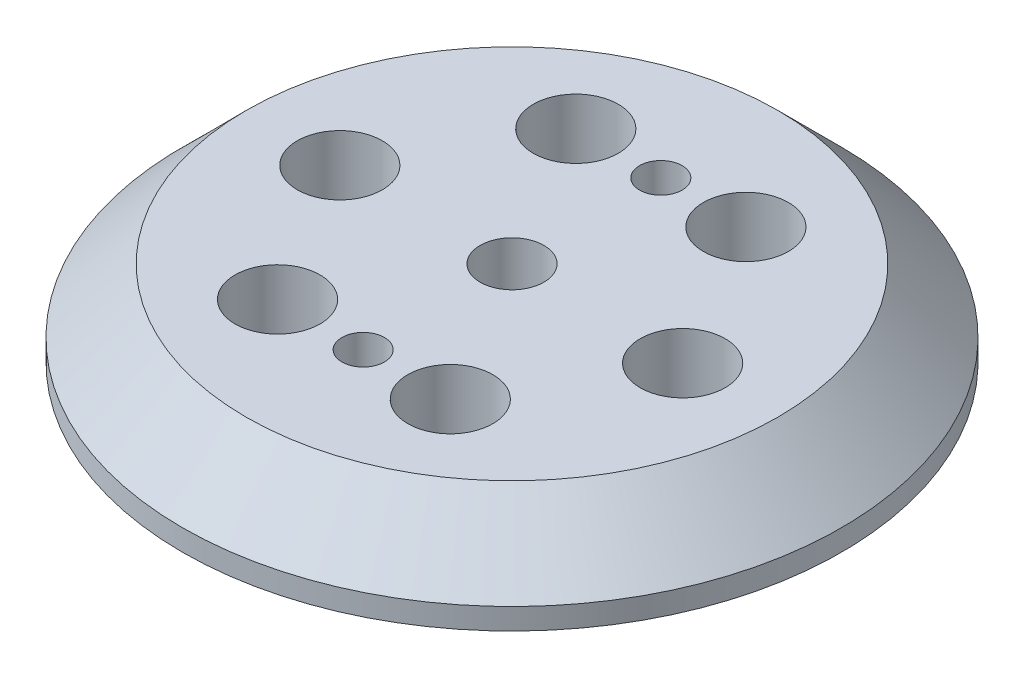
ISO-10303-21;
HEADER;
FILE_DESCRIPTION(('STEP AP214'),'2;1');
FILE_NAME('part.step','',(''),(''),'','','');
FILE_SCHEMA(('AUTOMOTIVE_DESIGN { 1 0 10303 214 1 1 1 1 }'));
ENDSEC;
DATA;
#1=APPLICATION_CONTEXT('core data for automotive mechanical design processes');
#2=APPLICATION_PROTOCOL_DEFINITION('international standard','automotive_design',2000,#1);
#3=PRODUCT_CONTEXT('',#1,'mechanical');
#4=PRODUCT('Part','Part','',(#3));
#5=PRODUCT_RELATED_PRODUCT_CATEGORY('part','',(#4));
#6=PRODUCT_DEFINITION_FORMATION('','',#4);
#7=PRODUCT_DEFINITION_CONTEXT('part definition',#1,'design');
#8=PRODUCT_DEFINITION('design','',#6,#7);
#9=PRODUCT_DEFINITION_SHAPE('','',#8);
#10=(LENGTH_UNIT() NAMED_UNIT(*) SI_UNIT(.MILLI.,.METRE.));
#11=(NAMED_UNIT(*) PLANE_ANGLE_UNIT() SI_UNIT($,.RADIAN.));
#12=(NAMED_UNIT(*) SI_UNIT($,.STERADIAN.) SOLID_ANGLE_UNIT());
#13=UNCERTAINTY_MEASURE_WITH_UNIT(LENGTH_MEASURE(1.E-05),#10,'distance_accuracy_value','');
#14=(GEOMETRIC_REPRESENTATION_CONTEXT(3) GLOBAL_UNCERTAINTY_ASSIGNED_CONTEXT((#13)) GLOBAL_UNIT_ASSIGNED_CONTEXT((#10,
#11,#12)) REPRESENTATION_CONTEXT('',''));
#15=CARTESIAN_POINT('',(0.,0.,0.));
#16=DIRECTION('',(0.,0.,1.));
#17=DIRECTION('',(1.,0.,0.));
#18=AXIS2_PLACEMENT_3D('',#15,#16,#17);
#19=CARTESIAN_POINT('',(0.,4.,0.));
#20=DIRECTION('',(0.,-1.,0.));
#21=DIRECTION('',(0.,0.,-1.));
#22=AXIS2_PLACEMENT_3D('',#19,#20,#21);
#23=CYLINDRICAL_SURFACE('',#22,15.5);
#24=CARTESIAN_POINT('',(0.,0.999999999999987,0.));
#25=DIRECTION('',(0.,1.,0.));
#26=DIRECTION('',(0.,0.,1.));
#27=AXIS2_PLACEMENT_3D('',#24,#25,#26);
#28=CIRCLE('',#27,15.5);
#29=CARTESIAN_POINT('',(0.,0.999999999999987,15.5));
#30=VERTEX_POINT('',#29);
#31=EDGE_CURVE('E10',#30,#30,#28,.F.);
#32=ORIENTED_EDGE('',*,*,#31,.T.);
#33=EDGE_LOOP('',(#32));
#34=FACE_BOUND('',#33,.T.);
#35=CARTESIAN_POINT('',(0.,0.,0.));
#36=DIRECTION('',(0.,1.,0.));
#37=DIRECTION('',(0.,0.,1.));
#38=AXIS2_PLACEMENT_3D('',#35,#36,#37);
#39=CIRCLE('',#38,15.5);
#40=CARTESIAN_POINT('',(0.,0.,15.5));
#41=VERTEX_POINT('',#40);
#42=EDGE_CURVE('E59',#41,#41,#39,.T.);
#43=ORIENTED_EDGE('',*,*,#42,.T.);
#44=EDGE_LOOP('',(#43));
#45=FACE_BOUND('',#44,.T.);
#46=ADVANCED_FACE('F45',(#34,#45),#23,.T.);
#47=CARTESIAN_POINT('',(0.,4.,0.));
#48=DIRECTION('',(0.,1.,0.));
#49=DIRECTION('',(0.,0.,1.));
#50=AXIS2_PLACEMENT_3D('',#47,#48,#49);
#51=PLANE('',#50);
#52=CARTESIAN_POINT('',(0.,4.,-7.));
#53=DIRECTION('',(0.,1.,0.));
#54=DIRECTION('',(0.,0.,1.));
#55=AXIS2_PLACEMENT_3D('',#52,#53,#54);
#56=CIRCLE('',#55,1.);
#57=CARTESIAN_POINT('',(0.,4.,-6.));
#58=VERTEX_POINT('',#57);
#59=EDGE_CURVE('E131',#58,#58,#56,.T.);
#60=ORIENTED_EDGE('',*,*,#59,.F.);
#61=EDGE_LOOP('',(#60));
#62=FACE_BOUND('',#61,.T.);
#63=CARTESIAN_POINT('',(0.,4.,7.));
#64=DIRECTION('',(0.,1.,0.));
#65=DIRECTION('',(0.,0.,1.));
#66=AXIS2_PLACEMENT_3D('',#63,#64,#65);
#67=CIRCLE('',#66,1.);
#68=CARTESIAN_POINT('',(0.,4.,8.));
#69=VERTEX_POINT('',#68);
#70=EDGE_CURVE('E127',#69,#69,#67,.T.);
#71=ORIENTED_EDGE('',*,*,#70,.F.);
#72=EDGE_LOOP('',(#71));
#73=FACE_BOUND('',#72,.T.);
#74=CARTESIAN_POINT('',(0.,4.,0.));
#75=DIRECTION('',(0.,1.,0.));
#76=DIRECTION('',(0.,0.,1.));
#77=AXIS2_PLACEMENT_3D('',#74,#75,#76);
#78=CIRCLE('',#77,1.5);
#79=CARTESIAN_POINT('',(0.,4.,1.5));
#80=VERTEX_POINT('',#79);
#81=EDGE_CURVE('E115',#80,#80,#78,.T.);
#82=ORIENTED_EDGE('',*,*,#81,.F.);
#83=EDGE_LOOP('',(#82));
#84=FACE_BOUND('',#83,.T.);
#85=CARTESIAN_POINT('',(-8.06217782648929,4.,0.035898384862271));
#86=DIRECTION('',(0.,1.,0.));
#87=DIRECTION('',(0.,0.,1.));
#88=AXIS2_PLACEMENT_3D('',#85,#86,#87);
#89=CIRCLE('',#88,2.00000000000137);
#90=CARTESIAN_POINT('',(-8.06217782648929,4.,2.03589838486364));
#91=VERTEX_POINT('',#90);
#92=EDGE_CURVE('E95',#91,#91,#89,.T.);
#93=ORIENTED_EDGE('',*,*,#92,.F.);
#94=EDGE_LOOP('',(#93));
#95=FACE_BOUND('',#94,.T.);
#96=CARTESIAN_POINT('',(8.06217782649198,4.,0.0358983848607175));
#97=DIRECTION('',(0.,1.,0.));
#98=DIRECTION('',(0.,0.,1.));
#99=AXIS2_PLACEMENT_3D('',#96,#97,#98);
#100=CIRCLE('',#99,2.00000000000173);
#101=CARTESIAN_POINT('',(8.06217782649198,4.,2.03589838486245));
#102=VERTEX_POINT('',#101);
#103=EDGE_CURVE('E80',#102,#102,#100,.T.);
#104=ORIENTED_EDGE('',*,*,#103,.F.);
#105=EDGE_LOOP('',(#104));
#106=FACE_BOUND('',#105,.T.);
#107=CARTESIAN_POINT('',(4.06217782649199,4.,6.96410161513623));
#108=DIRECTION('',(0.,1.,0.));
#109=DIRECTION('',(0.,0.,1.));
#110=AXIS2_PLACEMENT_3D('',#107,#108,#109);
#111=CIRCLE('',#110,2.00000000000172);
#112=CARTESIAN_POINT('',(4.06217782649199,4.,8.96410161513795));
#113=VERTEX_POINT('',#112);
#114=EDGE_CURVE('E79',#113,#113,#111,.T.);
#115=ORIENTED_EDGE('',*,*,#114,.F.);
#116=EDGE_LOOP('',(#115));
#117=FACE_BOUND('',#116,.T.);
#118=CARTESIAN_POINT('',(-4.,4.,-7.));
#119=DIRECTION('',(0.,1.,0.));
#120=DIRECTION('',(0.,0.,1.));
#121=AXIS2_PLACEMENT_3D('',#118,#119,#120);
#122=CIRCLE('',#121,2.);
#123=CARTESIAN_POINT('',(-4.,4.,-5.));
#124=VERTEX_POINT('',#123);
#125=EDGE_CURVE('E71',#124,#124,#122,.T.);
#126=ORIENTED_EDGE('',*,*,#125,.F.);
#127=EDGE_LOOP('',(#126));
#128=FACE_BOUND('',#127,.T.);
#129=CARTESIAN_POINT('',(-4.06217782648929,4.,6.96410161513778));
#130=DIRECTION('',(0.,1.,0.));
#131=DIRECTION('',(0.,0.,1.));
#132=AXIS2_PLACEMENT_3D('',#129,#130,#131);
#133=CIRCLE('',#132,2.00000000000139);
#134=CARTESIAN_POINT('',(-4.06217782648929,4.,8.96410161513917));
#135=VERTEX_POINT('',#134);
#136=EDGE_CURVE('E96',#135,#135,#133,.T.);
#137=ORIENTED_EDGE('',*,*,#136,.F.);
#138=EDGE_LOOP('',(#137));
#139=FACE_BOUND('',#138,.T.);
#140=CARTESIAN_POINT('',(4.,4.,-7.));
#141=DIRECTION('',(0.,1.,0.));
#142=DIRECTION('',(0.,0.,1.));
#143=AXIS2_PLACEMENT_3D('',#140,#141,#142);
#144=CIRCLE('',#143,2.);
#145=CARTESIAN_POINT('',(4.,4.,-5.));
#146=VERTEX_POINT('',#145);
#147=EDGE_CURVE('E67',#146,#146,#144,.T.);
#148=ORIENTED_EDGE('',*,*,#147,.F.);
#149=EDGE_LOOP('',(#148));
#150=FACE_BOUND('',#149,.T.);
#151=CARTESIAN_POINT('',(0.,4.,0.));
#152=DIRECTION('',(0.,1.,0.));
#153=DIRECTION('',(0.,0.,1.));
#154=AXIS2_PLACEMENT_3D('',#151,#152,#153);
#155=CIRCLE('',#154,12.5);
#156=CARTESIAN_POINT('',(0.,4.,12.5));
#157=VERTEX_POINT('',#156);
#158=EDGE_CURVE('E54',#157,#157,#155,.T.);
#159=ORIENTED_EDGE('',*,*,#158,.T.);
#160=EDGE_LOOP('',(#159));
#161=FACE_BOUND('',#160,.T.);
#162=ADVANCED_FACE('F149',(#62,#73,#84,#95,#106,#117,#128,#139,#150,#161),#51,.T.);
#163=CARTESIAN_POINT('',(0.,0.,0.));
#164=DIRECTION('',(0.,1.,0.));
#165=DIRECTION('',(0.,0.,1.));
#166=AXIS2_PLACEMENT_3D('',#163,#164,#165);
#167=PLANE('',#166);
#168=CARTESIAN_POINT('',(0.,0.,-7.));
#169=DIRECTION('',(0.,1.,0.));
#170=DIRECTION('',(0.,0.,1.));
#171=AXIS2_PLACEMENT_3D('',#168,#169,#170);
#172=CIRCLE('',#171,1.);
#173=CARTESIAN_POINT('',(0.,0.,-6.));
#174=VERTEX_POINT('',#173);
#175=EDGE_CURVE('E119',#174,#174,#172,.T.);
#176=ORIENTED_EDGE('',*,*,#175,.T.);
#177=EDGE_LOOP('',(#176));
#178=FACE_BOUND('',#177,.T.);
#179=CARTESIAN_POINT('',(0.,0.,7.));
#180=DIRECTION('',(0.,1.,0.));
#181=DIRECTION('',(0.,0.,1.));
#182=AXIS2_PLACEMENT_3D('',#179,#180,#181);
#183=CIRCLE('',#182,1.);
#184=CARTESIAN_POINT('',(0.,0.,8.));
#185=VERTEX_POINT('',#184);
#186=EDGE_CURVE('E123',#185,#185,#183,.T.);
#187=ORIENTED_EDGE('',*,*,#186,.T.);
#188=EDGE_LOOP('',(#187));
#189=FACE_BOUND('',#188,.T.);
#190=CARTESIAN_POINT('',(0.,0.,0.));
#191=DIRECTION('',(0.,1.,0.));
#192=DIRECTION('',(0.,0.,1.));
#193=AXIS2_PLACEMENT_3D('',#190,#191,#192);
#194=CIRCLE('',#193,1.5);
#195=CARTESIAN_POINT('',(0.,0.,1.5));
#196=VERTEX_POINT('',#195);
#197=EDGE_CURVE('E111',#196,#196,#194,.T.);
#198=ORIENTED_EDGE('',*,*,#197,.T.);
#199=EDGE_LOOP('',(#198));
#200=FACE_BOUND('',#199,.T.);
#201=CARTESIAN_POINT('',(-8.06217782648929,0.,0.035898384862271));
#202=DIRECTION('',(0.,1.,0.));
#203=DIRECTION('',(0.,0.,1.));
#204=AXIS2_PLACEMENT_3D('',#201,#202,#203);
#205=CIRCLE('',#204,2.00000000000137);
#206=CARTESIAN_POINT('',(-8.06217782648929,0.,2.03589838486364));
#207=VERTEX_POINT('',#206);
#208=EDGE_CURVE('E91',#207,#207,#205,.T.);
#209=ORIENTED_EDGE('',*,*,#208,.T.);
#210=EDGE_LOOP('',(#209));
#211=FACE_BOUND('',#210,.T.);
#212=CARTESIAN_POINT('',(8.06217782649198,0.,0.0358983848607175));
#213=DIRECTION('',(0.,1.,0.));
#214=DIRECTION('',(0.,0.,1.));
#215=AXIS2_PLACEMENT_3D('',#212,#213,#214);
#216=CIRCLE('',#215,2.00000000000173);
#217=CARTESIAN_POINT('',(8.06217782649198,0.,2.03589838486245));
#218=VERTEX_POINT('',#217);
#219=EDGE_CURVE('E100',#218,#218,#216,.T.);
#220=ORIENTED_EDGE('',*,*,#219,.T.);
#221=EDGE_LOOP('',(#220));
#222=FACE_BOUND('',#221,.T.);
#223=CARTESIAN_POINT('',(4.06217782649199,0.,6.96410161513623));
#224=DIRECTION('',(0.,1.,0.));
#225=DIRECTION('',(0.,0.,1.));
#226=AXIS2_PLACEMENT_3D('',#223,#224,#225);
#227=CIRCLE('',#226,2.00000000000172);
#228=CARTESIAN_POINT('',(4.06217782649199,0.,8.96410161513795));
#229=VERTEX_POINT('',#228);
#230=EDGE_CURVE('E75',#229,#229,#227,.T.);
#231=ORIENTED_EDGE('',*,*,#230,.T.);
#232=EDGE_LOOP('',(#231));
#233=FACE_BOUND('',#232,.T.);
#234=CARTESIAN_POINT('',(-4.,0.,-7.));
#235=DIRECTION('',(0.,1.,0.));
#236=DIRECTION('',(0.,0.,1.));
#237=AXIS2_PLACEMENT_3D('',#234,#235,#236);
#238=CIRCLE('',#237,2.);
#239=CARTESIAN_POINT('',(-4.,0.,-5.));
#240=VERTEX_POINT('',#239);
#241=EDGE_CURVE('E84',#240,#240,#238,.T.);
#242=ORIENTED_EDGE('',*,*,#241,.T.);
#243=EDGE_LOOP('',(#242));
#244=FACE_BOUND('',#243,.T.);
#245=CARTESIAN_POINT('',(-4.06217782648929,0.,6.96410161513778));
#246=DIRECTION('',(0.,1.,0.));
#247=DIRECTION('',(0.,0.,1.));
#248=AXIS2_PLACEMENT_3D('',#245,#246,#247);
#249=CIRCLE('',#248,2.00000000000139);
#250=CARTESIAN_POINT('',(-4.06217782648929,0.,8.96410161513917));
#251=VERTEX_POINT('',#250);
#252=EDGE_CURVE('E107',#251,#251,#249,.T.);
#253=ORIENTED_EDGE('',*,*,#252,.T.);
#254=EDGE_LOOP('',(#253));
#255=FACE_BOUND('',#254,.T.);
#256=CARTESIAN_POINT('',(4.,0.,-7.));
#257=DIRECTION('',(0.,1.,0.));
#258=DIRECTION('',(0.,0.,1.));
#259=AXIS2_PLACEMENT_3D('',#256,#257,#258);
#260=CIRCLE('',#259,2.);
#261=CARTESIAN_POINT('',(4.,0.,-5.));
#262=VERTEX_POINT('',#261);
#263=EDGE_CURVE('E64',#262,#262,#260,.T.);
#264=ORIENTED_EDGE('',*,*,#263,.T.);
#265=EDGE_LOOP('',(#264));
#266=FACE_BOUND('',#265,.T.);
#267=ORIENTED_EDGE('',*,*,#42,.F.);
#268=EDGE_LOOP('',(#267));
#269=FACE_BOUND('',#268,.T.);
#270=ADVANCED_FACE('F139',(#178,#189,#200,#211,#222,#233,#244,#255,#266,#269),#167,.F.);
#271=CARTESIAN_POINT('',(0.,4.,0.));
#272=DIRECTION('',(0.,-1.,0.));
#273=DIRECTION('',(0.,0.,-1.));
#274=AXIS2_PLACEMENT_3D('',#271,#272,#273);
#275=CONICAL_SURFACE('',#274,12.5,0.785398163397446);
#276=ORIENTED_EDGE('',*,*,#31,.F.);
#277=EDGE_LOOP('',(#276));
#278=FACE_BOUND('',#277,.T.);
#279=ORIENTED_EDGE('',*,*,#158,.F.);
#280=EDGE_LOOP('',(#279));
#281=FACE_BOUND('',#280,.T.);
#282=ADVANCED_FACE('F48',(#278,#281),#275,.T.);
#283=CARTESIAN_POINT('',(4.,0.,-7.));
#284=DIRECTION('',(0.,1.,0.));
#285=DIRECTION('',(0.,0.,1.));
#286=AXIS2_PLACEMENT_3D('',#283,#284,#285);
#287=CYLINDRICAL_SURFACE('',#286,2.);
#288=ORIENTED_EDGE('',*,*,#263,.F.);
#289=EDGE_LOOP('',(#288));
#290=FACE_BOUND('',#289,.T.);
#291=ORIENTED_EDGE('',*,*,#147,.T.);
#292=EDGE_LOOP('',(#291));
#293=FACE_BOUND('',#292,.T.);
#294=ADVANCED_FACE('F169',(#290,#293),#287,.F.);
#295=CARTESIAN_POINT('',(-4.06217782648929,0.,6.96410161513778));
#296=DIRECTION('',(0.,1.,0.));
#297=DIRECTION('',(0.,0.,1.));
#298=AXIS2_PLACEMENT_3D('',#295,#296,#297);
#299=CYLINDRICAL_SURFACE('',#298,2.00000000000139);
#300=ORIENTED_EDGE('',*,*,#252,.F.);
#301=EDGE_LOOP('',(#300));
#302=FACE_BOUND('',#301,.T.);
#303=ORIENTED_EDGE('',*,*,#136,.T.);
#304=EDGE_LOOP('',(#303));
#305=FACE_BOUND('',#304,.T.);
#306=ADVANCED_FACE('F171',(#302,#305),#299,.F.);
#307=CARTESIAN_POINT('',(-4.,0.,-7.));
#308=DIRECTION('',(0.,1.,0.));
#309=DIRECTION('',(0.,0.,1.));
#310=AXIS2_PLACEMENT_3D('',#307,#308,#309);
#311=CYLINDRICAL_SURFACE('',#310,2.);
#312=ORIENTED_EDGE('',*,*,#241,.F.);
#313=EDGE_LOOP('',(#312));
#314=FACE_BOUND('',#313,.T.);
#315=ORIENTED_EDGE('',*,*,#125,.T.);
#316=EDGE_LOOP('',(#315));
#317=FACE_BOUND('',#316,.T.);
#318=ADVANCED_FACE('F178',(#314,#317),#311,.F.);
#319=CARTESIAN_POINT('',(4.06217782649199,0.,6.96410161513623));
#320=DIRECTION('',(0.,1.,0.));
#321=DIRECTION('',(0.,0.,1.));
#322=AXIS2_PLACEMENT_3D('',#319,#320,#321);
#323=CYLINDRICAL_SURFACE('',#322,2.00000000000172);
#324=ORIENTED_EDGE('',*,*,#230,.F.);
#325=EDGE_LOOP('',(#324));
#326=FACE_BOUND('',#325,.T.);
#327=ORIENTED_EDGE('',*,*,#114,.T.);
#328=EDGE_LOOP('',(#327));
#329=FACE_BOUND('',#328,.T.);
#330=ADVANCED_FACE('F237',(#326,#329),#323,.F.);
#331=CARTESIAN_POINT('',(8.06217782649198,0.,0.0358983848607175));
#332=DIRECTION('',(0.,1.,0.));
#333=DIRECTION('',(0.,0.,1.));
#334=AXIS2_PLACEMENT_3D('',#331,#332,#333);
#335=CYLINDRICAL_SURFACE('',#334,2.00000000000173);
#336=ORIENTED_EDGE('',*,*,#219,.F.);
#337=EDGE_LOOP('',(#336));
#338=FACE_BOUND('',#337,.T.);
#339=ORIENTED_EDGE('',*,*,#103,.T.);
#340=EDGE_LOOP('',(#339));
#341=FACE_BOUND('',#340,.T.);
#342=ADVANCED_FACE('F228',(#338,#341),#335,.F.);
#343=CARTESIAN_POINT('',(-8.06217782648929,0.,0.035898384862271));
#344=DIRECTION('',(0.,1.,0.));
#345=DIRECTION('',(0.,0.,1.));
#346=AXIS2_PLACEMENT_3D('',#343,#344,#345);
#347=CYLINDRICAL_SURFACE('',#346,2.00000000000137);
#348=ORIENTED_EDGE('',*,*,#208,.F.);
#349=EDGE_LOOP('',(#348));
#350=FACE_BOUND('',#349,.T.);
#351=ORIENTED_EDGE('',*,*,#92,.T.);
#352=EDGE_LOOP('',(#351));
#353=FACE_BOUND('',#352,.T.);
#354=ADVANCED_FACE('F219',(#350,#353),#347,.F.);
#355=CARTESIAN_POINT('',(0.,0.,0.));
#356=DIRECTION('',(0.,1.,0.));
#357=DIRECTION('',(0.,0.,1.));
#358=AXIS2_PLACEMENT_3D('',#355,#356,#357);
#359=CYLINDRICAL_SURFACE('',#358,1.5);
#360=ORIENTED_EDGE('',*,*,#197,.F.);
#361=EDGE_LOOP('',(#360));
#362=FACE_BOUND('',#361,.T.);
#363=ORIENTED_EDGE('',*,*,#81,.T.);
#364=EDGE_LOOP('',(#363));
#365=FACE_BOUND('',#364,.T.);
#366=ADVANCED_FACE('F202',(#362,#365),#359,.F.);
#367=CARTESIAN_POINT('',(0.,0.,7.));
#368=DIRECTION('',(0.,1.,0.));
#369=DIRECTION('',(0.,0.,1.));
#370=AXIS2_PLACEMENT_3D('',#367,#368,#369);
#371=CYLINDRICAL_SURFACE('',#370,1.);
#372=ORIENTED_EDGE('',*,*,#186,.F.);
#373=EDGE_LOOP('',(#372));
#374=FACE_BOUND('',#373,.T.);
#375=ORIENTED_EDGE('',*,*,#70,.T.);
#376=EDGE_LOOP('',(#375));
#377=FACE_BOUND('',#376,.T.);
#378=ADVANCED_FACE('F145',(#374,#377),#371,.F.);
#379=CARTESIAN_POINT('',(0.,0.,-7.));
#380=DIRECTION('',(0.,1.,0.));
#381=DIRECTION('',(0.,0.,1.));
#382=AXIS2_PLACEMENT_3D('',#379,#380,#381);
#383=CYLINDRICAL_SURFACE('',#382,1.);
#384=ORIENTED_EDGE('',*,*,#175,.F.);
#385=EDGE_LOOP('',(#384));
#386=FACE_BOUND('',#385,.T.);
#387=ORIENTED_EDGE('',*,*,#59,.T.);
#388=EDGE_LOOP('',(#387));
#389=FACE_BOUND('',#388,.T.);
#390=ADVANCED_FACE('F142',(#386,#389),#383,.F.);
#391=CLOSED_SHELL('',(#46,#162,#270,#282,#294,#306,#318,#330,#342,#354,#366,#378,#390));
#392=MANIFOLD_SOLID_BREP('B2',#391);
#393=ADVANCED_BREP_SHAPE_REPRESENTATION('',(#18,#392),#14);
#394=SHAPE_DEFINITION_REPRESENTATION(#9,#393);
ENDSEC;
END-ISO-10303-21;
